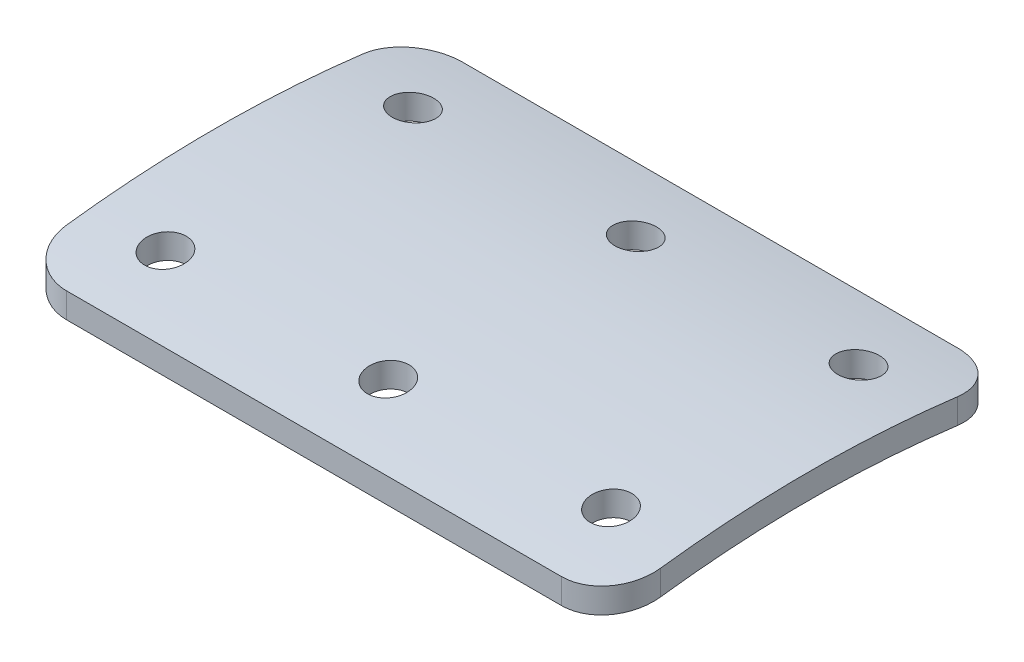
from build123d import *

# Parameters (mm, degrees)
SHELL1_T             = -3.175
SKETCH2_W            = 234.95
SKETCH2_H            = 34.925
CUT_EXTRUDE1_DEPTH   = 254
SKETCH5_W            = 76.2
SKETCH5_H            = 215.9
CUT_EXTRUDE4_DEPTH   = 152.4
SKETCH7_R            = 104.965327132
BOSS_EXTRUDE1_DEPTH  = 6.35
SKETCH8_R            = 82.55
CUT_EXTRUDE5_DEPTH   = 6.35
SKETCH9_R            = 2.54
CUT_EXTRUDE6_DEPTH   = 647.578440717
CIRPATTERN1_COUNT    = 6
SKETCH10_OUTSIDE_W   = 760.92
SKETCH10_OUTSIDE_H   = 456.12
SKETCH10_OUTSIDE_W_2 = 76.2
SKETCH10_OUTSIDE_H_2 = 50.8
CUT_EXTRUDE7_DEPTH   = 254
SKETCH11_W           = 76.2
SKETCH11_H           = 50.8
CUT_EXTRUDE8_DEPTH   = 523.476518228
SKETCH12_R           = 2.667
CUT_EXTRUDE12_DEPTH  = 254
FILLET1_R            = 6.35


with BuildPart() as part:
    # Sketch1 → Revolve2 (revolve)
    with BuildSketch(Plane.XY, mode=Mode.PRIVATE) as revolve2_sk:
        with BuildLine():
            Line((0, 152.4), (499.11, 152.4))
            ThreePointArc((499.11, 152.4), (606.873073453, 107.763073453), (651.51, 0))
            Line((651.51, 0), (0, 0))
            Line((0, 0), (0, 152.4))
        make_face()
    revolve(revolve2_sk.sketch.rotate(Axis((0, 0, 0), (1, 0, 0)), 180), axis=Axis((0, 0, 0), (1, 0, 0)))

    # Shell1
    shell1_openings = [part.faces().sort_by_distance(p)[0] for p in [
        (0, 0, 0),
    ]]
    offset(amount=SHELL1_T, openings=shell1_openings, kind=Kind.INTERSECTION)

    # Sketch2 → Cut-Extrude1 (cut, symmetric)
    with BuildSketch(Plane.XY):
        with Locations((485.775, 0.0127)):
            Rectangle(SKETCH2_W, SKETCH2_H)
    extrude(amount=CUT_EXTRUDE1_DEPTH, both=True, mode=Mode.SUBTRACT)

    # Sketch5 → Cut-Extrude4 (cut, symmetric)
    with BuildSketch(Plane.XY):
        with Locations((647.7, 0)):
            Rectangle(SKETCH5_W, SKETCH5_H)
    extrude(amount=CUT_EXTRUDE4_DEPTH, both=True, mode=Mode.SUBTRACT)

    # Sketch7 → Boss-Extrude1 (add)
    with BuildSketch(Plane(origin=(609.6, 0, 0), x_dir=(0, 0, -1), z_dir=(1, 0, 0))):
        Circle(SKETCH7_R)
    extrude(amount=-BOSS_EXTRUDE1_DEPTH)

    # Sketch8 → Cut-Extrude5 (cut)
    with BuildSketch(Plane(origin=(609.6, 0, 0), x_dir=(0, 0, -1), z_dir=(1, 0, 0))):
        Circle(SKETCH8_R)
    extrude(amount=-CUT_EXTRUDE5_DEPTH, mode=Mode.SUBTRACT)

    # Sketch9 → Cut-Extrude6 (cut, through all)
    with BuildSketch(Plane(origin=(609.6, 0, 0), x_dir=(0, 0, -1), z_dir=(1, 0, 0))):
        with Locations((95.25, 0)):
            Circle(SKETCH9_R)
    cut_extrude6 = extrude(amount=-CUT_EXTRUDE6_DEPTH, mode=Mode.SUBTRACT)

    # CirPattern1: Cut-Extrude6 ×6 about axis
    cirpattern1_axis = Axis((0, 0, 0), (1, 0, 0))
    for i in range(1, CIRPATTERN1_COUNT):
        add(cut_extrude6.rotate(cirpattern1_axis, i * 360 / CIRPATTERN1_COUNT), mode=Mode.SUBTRACT)

    # Sketch10 outside → Cut-Extrude7 (cut, symmetric)
    with BuildSketch(Plane(origin=(0, 0, 0), x_dir=(1, 0, 0), z_dir=(0, 1, 0))):
        with Locations((304.8, 0)):
            Rectangle(SKETCH10_OUTSIDE_W, SKETCH10_OUTSIDE_H)
        with Locations((461.01, 0)):
            Rectangle(SKETCH10_OUTSIDE_W_2, SKETCH10_OUTSIDE_H_2, mode=Mode.SUBTRACT)
    extrude(amount=CUT_EXTRUDE7_DEPTH, both=True, mode=Mode.SUBTRACT)


with BuildPart() as cut_extrude7_piece_1:
    # of the separate pieces the step leaves, piece 1, a body of its own (cut_extrude7_pieces)
    add(part.part.solids().sort_by_distance((499.11, 150.268426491, -25.4))[0])

    # Sketch12 → Cut-Extrude12 (cut, symmetric)
    with BuildSketch(Plane(origin=(0, 0, 0), x_dir=(1, 0, 0), z_dir=(0, 1, 0))):
        with Locations(Location((432.435, -15.875, 0), (0, 0, 270))):
            Circle(SKETCH12_R)
        with Locations(Location((432.435, 15.875, 0), (0, 0, 270))):
            Circle(SKETCH12_R)
        with Locations(Location((461.01, 15.875, 0), (0, 0, 270))):
            Circle(SKETCH12_R)
        with Locations(Location((489.585, 15.875, 0), (0, 0, 270))):
            Circle(SKETCH12_R)
        with Locations(Location((489.585, -15.875, 0), (0, 0, 270))):
            Circle(SKETCH12_R)
        with Locations(Location((461.01, -15.875, 0), (0, 0, 270))):
            Circle(SKETCH12_R)
    extrude(amount=CUT_EXTRUDE12_DEPTH, both=True, mode=Mode.SUBTRACT)

    # Fillet1
    fillet1_edges = [cut_extrude7_piece_1.edges().sort_by_distance(p)[0] for p in [
        (422.91, 148.657917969, -25.4),
        (499.11, 148.657917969, 25.4),
        (422.91, 148.657917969, 25.4),
        (499.11, 148.657917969, -25.4),
    ]]
    fillet(fillet1_edges, radius=FILLET1_R)


with BuildPart() as cut_extrude7_piece_2:
    # of the separate pieces the step leaves, piece 2, a body of its own (cut_extrude7_pieces)
    add(part.part.solids().sort_by_distance((499.11, -150.268426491, -25.4))[0])

    # Sketch11 → Cut-Extrude8 (cut, through all)
    with BuildSketch(Plane(origin=(0, 0, 0), x_dir=(1, 0, 0), z_dir=(0, 1, 0))):
        with Locations((461.01, 0)):
            Rectangle(SKETCH11_W, SKETCH11_H)
    extrude(amount=-CUT_EXTRUDE8_DEPTH, mode=Mode.SUBTRACT)


solid = cut_extrude7_piece_1.part
